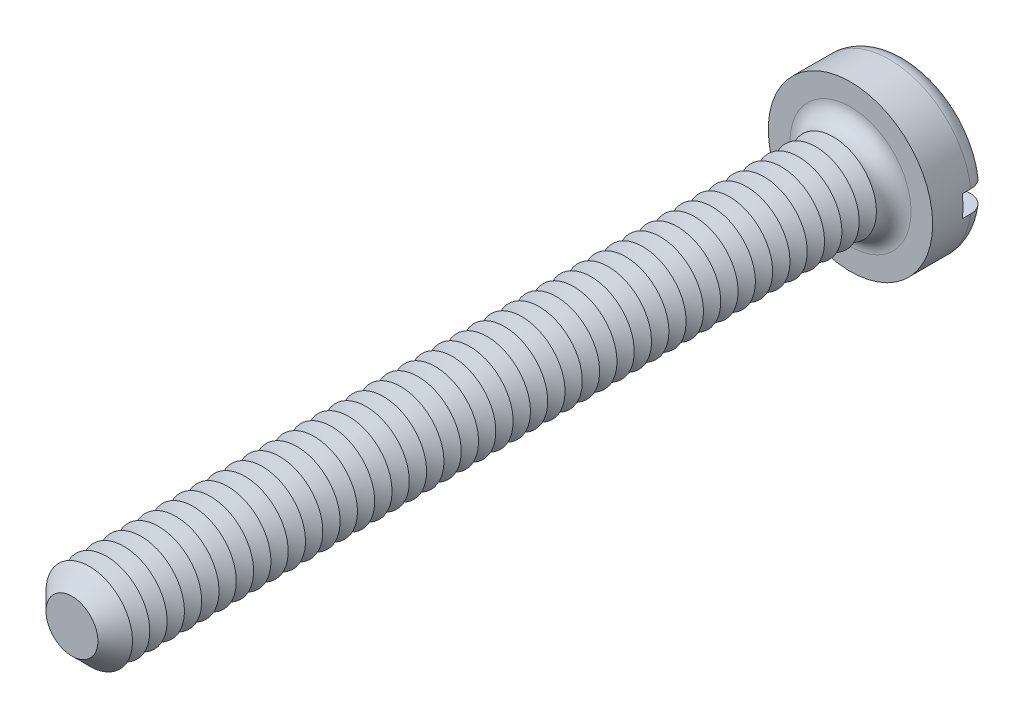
from build123d import *

# Parameters (mm, degrees)
SKETCH3_R           = 1.9
BOSS_EXTRUDE2_DEPTH = 1.3
SKETCH4_R           = 1
BOSS_EXTRUDE3_DEPTH = 18
FILLET1_R           = 0.4
CHAMFER1_SIZE       = 0.4
LPATTERN1_COUNT     = 43
LPATTERN1_PITCH     = 0.4
SKETCH8_W           = 3.8
SKETCH8_H           = 0.5
CUT_EXTRUDE1_DEPTH  = 0.6


with BuildPart() as part:
    # Sketch3 → Boss-Extrude2 (new body)
    with BuildSketch(Plane.XY):
        Circle(SKETCH3_R)
    extrude(amount=-BOSS_EXTRUDE2_DEPTH)

    # Sketch4 → Boss-Extrude3 (add)
    with BuildSketch(Plane.XY):
        Circle(SKETCH4_R)
    extrude(amount=BOSS_EXTRUDE3_DEPTH)

    # Fillet1
    fillet1_edges = [part.edges().sort_by_distance(p)[0] for p in [
        (-1.9, 0, -1.3),
        (-1, 0, 0),
    ]]
    fillet(fillet1_edges, radius=FILLET1_R)

    # Chamfer1
    chamfer1_edges = [part.edges().sort_by_distance(p)[0] for p in [
        (-1, 0, 18),
    ]]
    chamfer(chamfer1_edges, length=CHAMFER1_SIZE)

    # Sketch6 → Cut-Revolve1 (revolve, cut)
    with BuildSketch(Plane(origin=(0, 0, 0), x_dir=(0, 0, -1), z_dir=(1, 0, 0)), mode=Mode.PRIVATE) as cut_revolve1_sk:
        Polygon((-0.4, 1), (-0.6, 0.653589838), (-0.8, 1), align=None)
    cut_revolve1 = revolve(cut_revolve1_sk.sketch.rotate(Axis((0, 0, -1.694361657), (0, 0, 1)), 90), axis=Axis((0, 0, -1.694361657), (0, 0, 1)), mode=Mode.SUBTRACT)

    # LPattern1: Cut-Revolve1 ×43
    with Locations(*[(0, 0, i * LPATTERN1_PITCH) for i in range(1, LPATTERN1_COUNT)]):
        add(cut_revolve1, mode=Mode.SUBTRACT)

    # Sketch8 → Cut-Extrude1 (cut)
    with BuildSketch(Plane(origin=(0, 0, -1.3), x_dir=(-1, 0, 0), z_dir=(0, 0, -1))):
        Rectangle(SKETCH8_W, SKETCH8_H)
    extrude(amount=-CUT_EXTRUDE1_DEPTH, mode=Mode.SUBTRACT)


solid = part.part
